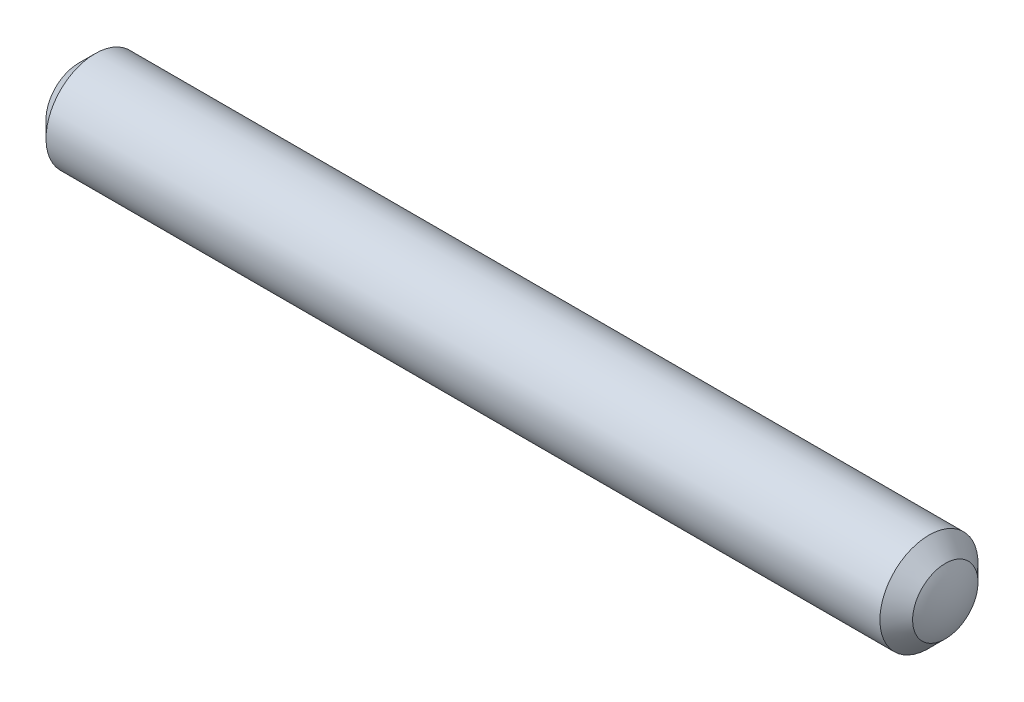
ISO-10303-21;
HEADER;
FILE_DESCRIPTION(('STEP AP214'),'2;1');
FILE_NAME('part.step','',(''),(''),'','','');
FILE_SCHEMA(('AUTOMOTIVE_DESIGN { 1 0 10303 214 1 1 1 1 }'));
ENDSEC;
DATA;
#1=APPLICATION_CONTEXT('core data for automotive mechanical design processes');
#2=APPLICATION_PROTOCOL_DEFINITION('international standard','automotive_design',2000,#1);
#3=PRODUCT_CONTEXT('',#1,'mechanical');
#4=PRODUCT('Part','Part','',(#3));
#5=PRODUCT_RELATED_PRODUCT_CATEGORY('part','',(#4));
#6=PRODUCT_DEFINITION_FORMATION('','',#4);
#7=PRODUCT_DEFINITION_CONTEXT('part definition',#1,'design');
#8=PRODUCT_DEFINITION('design','',#6,#7);
#9=PRODUCT_DEFINITION_SHAPE('','',#8);
#10=(LENGTH_UNIT() NAMED_UNIT(*) SI_UNIT(.MILLI.,.METRE.));
#11=(NAMED_UNIT(*) PLANE_ANGLE_UNIT() SI_UNIT($,.RADIAN.));
#12=(NAMED_UNIT(*) SI_UNIT($,.STERADIAN.) SOLID_ANGLE_UNIT());
#13=UNCERTAINTY_MEASURE_WITH_UNIT(LENGTH_MEASURE(1.E-05),#10,'distance_accuracy_value','');
#14=(GEOMETRIC_REPRESENTATION_CONTEXT(3) GLOBAL_UNCERTAINTY_ASSIGNED_CONTEXT((#13)) GLOBAL_UNIT_ASSIGNED_CONTEXT((#10,
#11,#12)) REPRESENTATION_CONTEXT('',''));
#15=CARTESIAN_POINT('',(0.,0.,0.));
#16=DIRECTION('',(0.,0.,1.));
#17=DIRECTION('',(1.,0.,0.));
#18=AXIS2_PLACEMENT_3D('',#15,#16,#17);
#19=CARTESIAN_POINT('',(-3.74999999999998,0.,0.));
#20=DIRECTION('',(0.,0.,1.));
#21=DIRECTION('',(1.,0.,0.));
#22=AXIS2_PLACEMENT_3D('',#19,#20,#21);
#23=SPHERICAL_SURFACE('',#22,4.24999999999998);
#24=CARTESIAN_POINT('',(-3.74999999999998,0.,0.));
#25=DIRECTION('',(1.,0.,0.));
#26=DIRECTION('',(0.,1.,0.));
#27=AXIS2_PLACEMENT_3D('',#24,#25,#26);
#28=SPHERICAL_SURFACE('',#27,4.24999999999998);
#29=CARTESIAN_POINT('',(0.,0.,0.));
#30=DIRECTION('',(1.,0.,0.));
#31=DIRECTION('',(0.,1.,0.));
#32=AXIS2_PLACEMENT_3D('',#29,#30,#31);
#33=CIRCLE('',#32,2.);
#34=CARTESIAN_POINT('',(0.,2.,0.));
#35=VERTEX_POINT('',#34);
#36=EDGE_CURVE('E12',#35,#35,#33,.T.);
#37=ORIENTED_EDGE('',*,*,#36,.T.);
#38=EDGE_LOOP('',(#37));
#39=FACE_BOUND('',#38,.T.);
#40=ADVANCED_FACE('F34',(#39),#28,.T.);
#41=CARTESIAN_POINT('',(0.,0.,0.));
#42=DIRECTION('',(-1.,0.,0.));
#43=DIRECTION('',(0.,-1.,0.));
#44=AXIS2_PLACEMENT_3D('',#41,#42,#43);
#45=CONICAL_SURFACE('',#44,2.,0.78539816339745);
#46=CARTESIAN_POINT('',(-1.,0.,0.));
#47=DIRECTION('',(1.,0.,0.));
#48=DIRECTION('',(0.,1.,0.));
#49=AXIS2_PLACEMENT_3D('',#46,#47,#48);
#50=CIRCLE('',#49,3.);
#51=CARTESIAN_POINT('',(-1.,3.,0.));
#52=VERTEX_POINT('',#51);
#53=EDGE_CURVE('E40',#52,#52,#50,.T.);
#54=ORIENTED_EDGE('',*,*,#53,.T.);
#55=EDGE_LOOP('',(#54));
#56=FACE_BOUND('',#55,.T.);
#57=ORIENTED_EDGE('',*,*,#36,.F.);
#58=EDGE_LOOP('',(#57));
#59=FACE_BOUND('',#58,.T.);
#60=ADVANCED_FACE('F66',(#56,#59),#45,.T.);
#61=CARTESIAN_POINT('',(0.,0.,0.));
#62=DIRECTION('',(1.,0.,0.));
#63=DIRECTION('',(0.,1.,0.));
#64=AXIS2_PLACEMENT_3D('',#61,#62,#63);
#65=CYLINDRICAL_SURFACE('',#64,3.);
#66=CARTESIAN_POINT('',(-52.,0.,0.));
#67=DIRECTION('',(1.,0.,0.));
#68=DIRECTION('',(0.,1.,0.));
#69=AXIS2_PLACEMENT_3D('',#66,#67,#68);
#70=CIRCLE('',#69,3.);
#71=CARTESIAN_POINT('',(-52.,2.99999999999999,0.));
#72=VERTEX_POINT('',#71);
#73=EDGE_CURVE('E44',#72,#72,#70,.T.);
#74=ORIENTED_EDGE('',*,*,#73,.T.);
#75=EDGE_LOOP('',(#74));
#76=FACE_BOUND('',#75,.T.);
#77=ORIENTED_EDGE('',*,*,#53,.F.);
#78=EDGE_LOOP('',(#77));
#79=FACE_BOUND('',#78,.T.);
#80=ADVANCED_FACE('F63',(#76,#79),#65,.T.);
#81=CARTESIAN_POINT('',(-52.,0.,0.));
#82=DIRECTION('',(1.,0.,0.));
#83=DIRECTION('',(0.,1.,0.));
#84=AXIS2_PLACEMENT_3D('',#81,#82,#83);
#85=CONICAL_SURFACE('',#84,3.,0.78539816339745);
#86=CARTESIAN_POINT('',(-53.,0.,0.));
#87=DIRECTION('',(1.,0.,0.));
#88=DIRECTION('',(0.,1.,0.));
#89=AXIS2_PLACEMENT_3D('',#86,#87,#88);
#90=CIRCLE('',#89,2.);
#91=CARTESIAN_POINT('',(-53.,2.,0.));
#92=VERTEX_POINT('',#91);
#93=EDGE_CURVE('E48',#92,#92,#90,.T.);
#94=ORIENTED_EDGE('',*,*,#93,.T.);
#95=EDGE_LOOP('',(#94));
#96=FACE_BOUND('',#95,.T.);
#97=ORIENTED_EDGE('',*,*,#73,.F.);
#98=EDGE_LOOP('',(#97));
#99=FACE_BOUND('',#98,.T.);
#100=ADVANCED_FACE('F54',(#96,#99),#85,.T.);
#101=CARTESIAN_POINT('',(-53.,2.,0.));
#102=DIRECTION('',(-1.,0.,0.));
#103=DIRECTION('',(0.,-1.,0.));
#104=AXIS2_PLACEMENT_3D('',#101,#102,#103);
#105=PLANE('',#104);
#106=ORIENTED_EDGE('',*,*,#93,.F.);
#107=EDGE_LOOP('',(#106));
#108=FACE_BOUND('',#107,.T.);
#109=ADVANCED_FACE('F57',(#108),#105,.T.);
#110=CLOSED_SHELL('',(#40,#60,#80,#100,#109));
#111=MANIFOLD_SOLID_BREP('B2',#110);
#112=ADVANCED_BREP_SHAPE_REPRESENTATION('',(#18,#111),#14);
#113=SHAPE_DEFINITION_REPRESENTATION(#9,#112);
ENDSEC;
END-ISO-10303-21;
